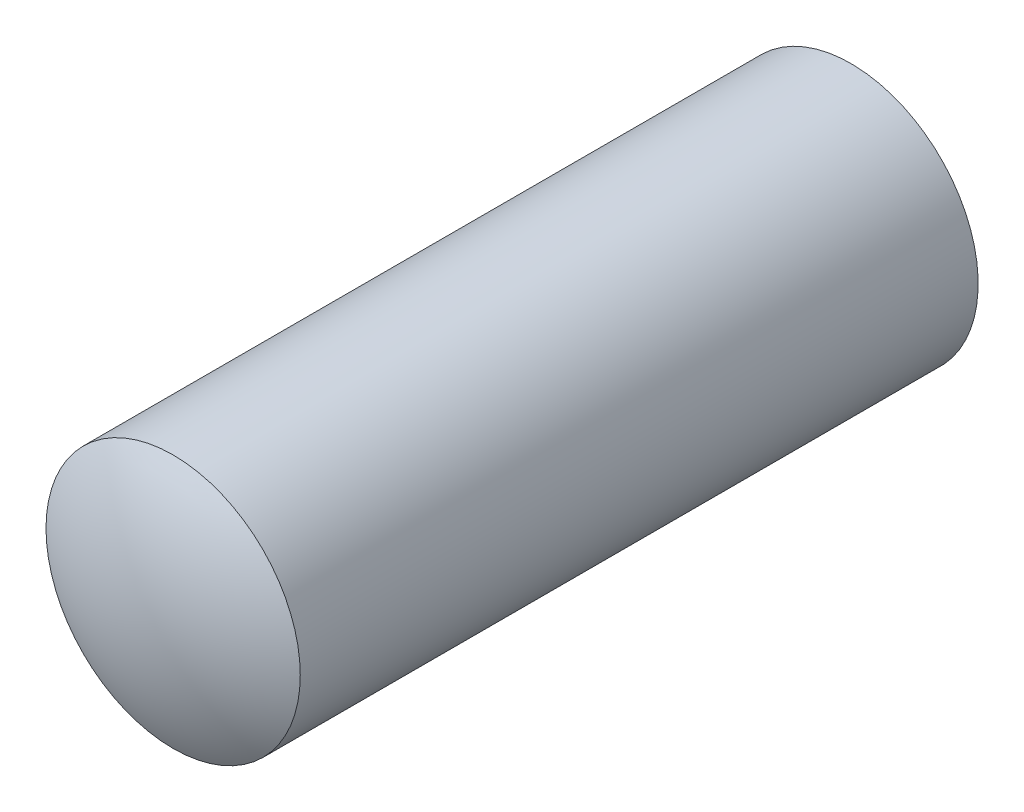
ISO-10303-21;
HEADER;
FILE_DESCRIPTION(('STEP AP214'),'2;1');
FILE_NAME('part.step','',(''),(''),'','','');
FILE_SCHEMA(('AUTOMOTIVE_DESIGN { 1 0 10303 214 1 1 1 1 }'));
ENDSEC;
DATA;
#1=APPLICATION_CONTEXT('core data for automotive mechanical design processes');
#2=APPLICATION_PROTOCOL_DEFINITION('international standard','automotive_design',2000,#1);
#3=PRODUCT_CONTEXT('',#1,'mechanical');
#4=PRODUCT('Part','Part','',(#3));
#5=PRODUCT_RELATED_PRODUCT_CATEGORY('part','',(#4));
#6=PRODUCT_DEFINITION_FORMATION('','',#4);
#7=PRODUCT_DEFINITION_CONTEXT('part definition',#1,'design');
#8=PRODUCT_DEFINITION('design','',#6,#7);
#9=PRODUCT_DEFINITION_SHAPE('','',#8);
#10=(LENGTH_UNIT() NAMED_UNIT(*) SI_UNIT(.MILLI.,.METRE.));
#11=(NAMED_UNIT(*) PLANE_ANGLE_UNIT() SI_UNIT($,.RADIAN.));
#12=(NAMED_UNIT(*) SI_UNIT($,.STERADIAN.) SOLID_ANGLE_UNIT());
#13=UNCERTAINTY_MEASURE_WITH_UNIT(LENGTH_MEASURE(1.E-05),#10,'distance_accuracy_value','');
#14=(GEOMETRIC_REPRESENTATION_CONTEXT(3) GLOBAL_UNCERTAINTY_ASSIGNED_CONTEXT((#13)) GLOBAL_UNIT_ASSIGNED_CONTEXT((#10,
#11,#12)) REPRESENTATION_CONTEXT('',''));
#15=CARTESIAN_POINT('',(0.,0.,0.));
#16=DIRECTION('',(0.,0.,1.));
#17=DIRECTION('',(1.,0.,0.));
#18=AXIS2_PLACEMENT_3D('',#15,#16,#17);
#19=CARTESIAN_POINT('',(0.,0.,18.));
#20=DIRECTION('',(0.,0.,-1.));
#21=DIRECTION('',(1.,0.,0.));
#22=AXIS2_PLACEMENT_3D('',#19,#20,#21);
#23=SPHERICAL_SURFACE('',#22,10.);
#24=CARTESIAN_POINT('',(0.,0.,26.6602540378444));
#25=DIRECTION('',(0.,0.,-1.));
#26=DIRECTION('',(-1.,0.,0.));
#27=AXIS2_PLACEMENT_3D('',#24,#25,#26);
#28=CIRCLE('',#27,5.);
#29=CARTESIAN_POINT('',(-5.,0.,26.6602540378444));
#30=VERTEX_POINT('',#29);
#31=EDGE_CURVE('E9',#30,#30,#28,.T.);
#32=ORIENTED_EDGE('',*,*,#31,.F.);
#33=EDGE_LOOP('',(#32));
#34=FACE_BOUND('',#33,.T.);
#35=ADVANCED_FACE('F14',(#34),#23,.T.);
#36=CARTESIAN_POINT('',(0.,0.,0.));
#37=DIRECTION('',(0.,0.,-1.));
#38=DIRECTION('',(-1.,0.,0.));
#39=AXIS2_PLACEMENT_3D('',#36,#37,#38);
#40=CYLINDRICAL_SURFACE('',#39,5.);
#41=ORIENTED_EDGE('',*,*,#31,.T.);
#42=EDGE_LOOP('',(#41));
#43=FACE_BOUND('',#42,.T.);
#44=CARTESIAN_POINT('',(0.,0.,0.));
#45=DIRECTION('',(0.,0.,-1.));
#46=DIRECTION('',(-1.,0.,0.));
#47=AXIS2_PLACEMENT_3D('',#44,#45,#46);
#48=CIRCLE('',#47,5.);
#49=CARTESIAN_POINT('',(-5.,0.,0.));
#50=VERTEX_POINT('',#49);
#51=EDGE_CURVE('E20',#50,#50,#48,.T.);
#52=ORIENTED_EDGE('',*,*,#51,.F.);
#53=EDGE_LOOP('',(#52));
#54=FACE_BOUND('',#53,.T.);
#55=ADVANCED_FACE('F28',(#43,#54),#40,.T.);
#56=CARTESIAN_POINT('',(0.,0.,0.));
#57=DIRECTION('',(0.,0.,1.));
#58=DIRECTION('',(1.,0.,0.));
#59=AXIS2_PLACEMENT_3D('',#56,#57,#58);
#60=PLANE('',#59);
#61=ORIENTED_EDGE('',*,*,#51,.T.);
#62=EDGE_LOOP('',(#61));
#63=FACE_BOUND('',#62,.T.);
#64=ADVANCED_FACE('F26',(#63),#60,.F.);
#65=CLOSED_SHELL('',(#35,#55,#64));
#66=MANIFOLD_SOLID_BREP('B1',#65);
#67=ADVANCED_BREP_SHAPE_REPRESENTATION('',(#18,#66),#14);
#68=SHAPE_DEFINITION_REPRESENTATION(#9,#67);
ENDSEC;
END-ISO-10303-21;
